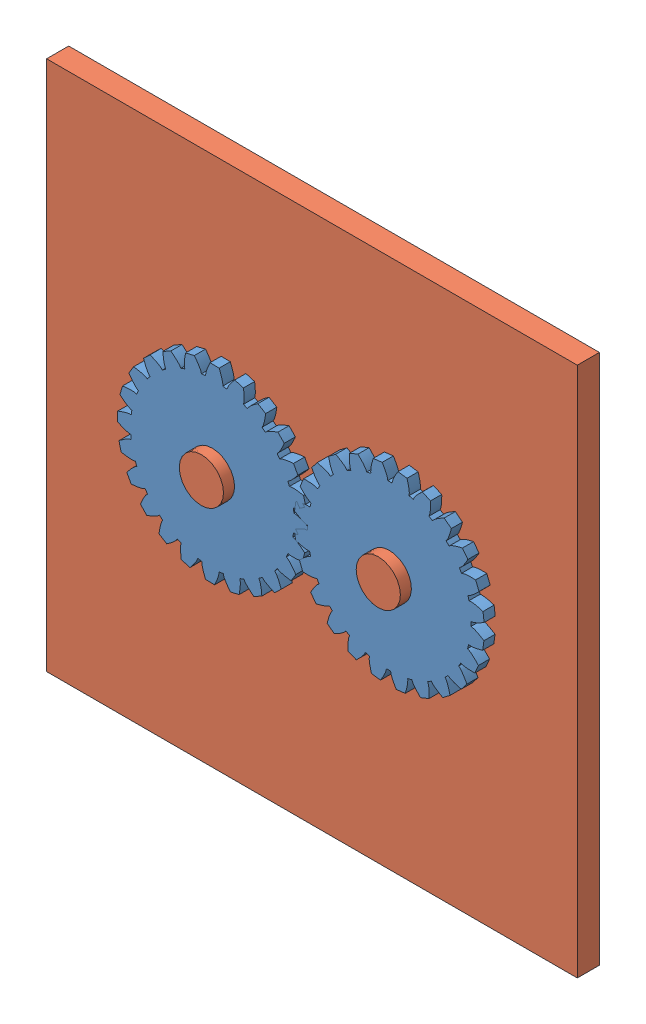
SolidWorks assembly 24toothasm2007.SLDASM, configuration Default (file format 3400). Lengths in mm.
Overall size (76.2 76.2 6.35).
3 component instances, 2 part files, 5 mates.
Components (placement in the parent):
- 24tooth2007-1: 24tooth2007.SLDPRT [Default] at (-53.6537 -13.3339 2.1551) x (0.956162 -0.29284 0) z (0 0 1) size (27.26 27.26 1.6)
- 24tooth2007-2: 24tooth2007.SLDPRT [Default] at (-79.0537 -13.3339 2.1551) x (-0.941776 -0.336241 0) z (0 0 1) size (27.26 27.26 1.6)
- 24mount2007-1: 24mount2007.SLDPRT [Default] at (-104.4537 -51.4339 -1.0199) size (76.2 76.2 6.35)
Mates (geometry in assembly coordinates):
- GearMate1: gear = 27.305 mm: cylinder of 24tooth2007-1; cylinder of 24tooth2007-2
- Concentric2: concentric anti-aligned: cylinder of 24tooth2007-2; cylinder of 24mount2007-1
- Coincident7: coincident anti-aligned: plane of 24tooth2007-2 through (-77.0654 -25.9071 2.1551) normal (0 0 -1); plane of 24mount2007-1 through (-104.4537 24.7661 2.1551) normal (0 0 1)
- Coincident8: coincident anti-aligned: plane of 24tooth2007-1 through (-47.7385 -2.0624 2.1551) normal (0 0 -1); plane of 24mount2007-1 through (-104.4537 24.7661 2.1551) normal (0 0 1)
- Concentric3: concentric anti-aligned: cylinder of 24tooth2007-1; cylinder of 24mount2007-1
